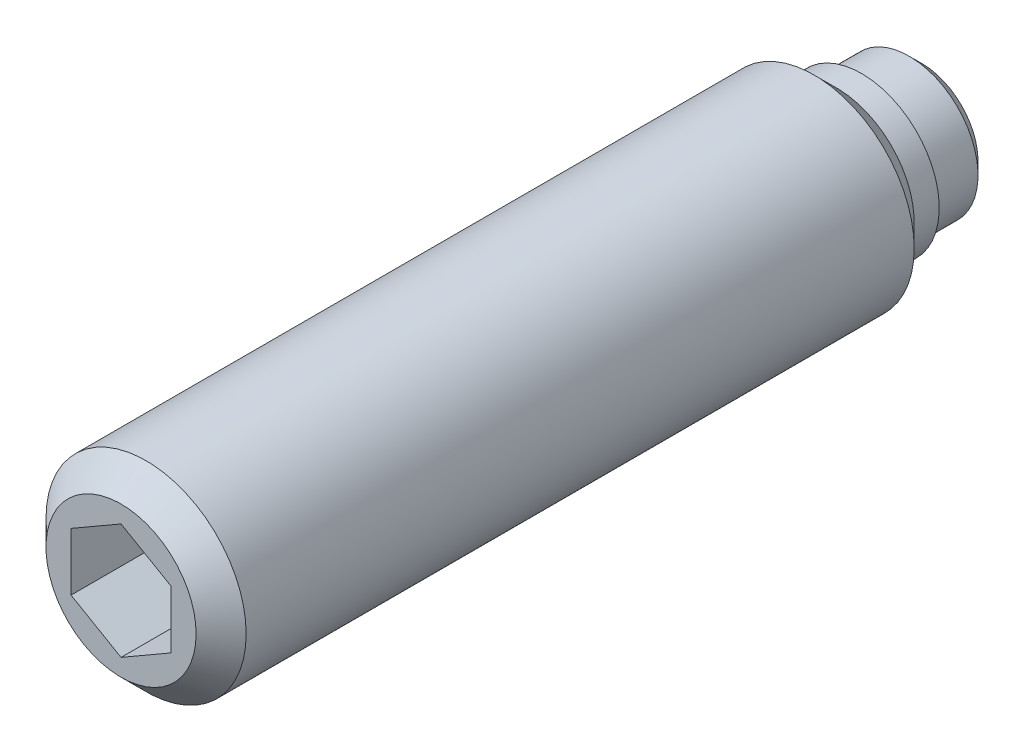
ISO-10303-21;
HEADER;
FILE_DESCRIPTION(('STEP AP214'),'2;1');
FILE_NAME('part.step','',(''),(''),'','','');
FILE_SCHEMA(('AUTOMOTIVE_DESIGN { 1 0 10303 214 1 1 1 1 }'));
ENDSEC;
DATA;
#1=APPLICATION_CONTEXT('core data for automotive mechanical design processes');
#2=APPLICATION_PROTOCOL_DEFINITION('international standard','automotive_design',2000,#1);
#3=PRODUCT_CONTEXT('',#1,'mechanical');
#4=PRODUCT('Part','Part','',(#3));
#5=PRODUCT_RELATED_PRODUCT_CATEGORY('part','',(#4));
#6=PRODUCT_DEFINITION_FORMATION('','',#4);
#7=PRODUCT_DEFINITION_CONTEXT('part definition',#1,'design');
#8=PRODUCT_DEFINITION('design','',#6,#7);
#9=PRODUCT_DEFINITION_SHAPE('','',#8);
#10=(LENGTH_UNIT() NAMED_UNIT(*) SI_UNIT(.MILLI.,.METRE.));
#11=(NAMED_UNIT(*) PLANE_ANGLE_UNIT() SI_UNIT($,.RADIAN.));
#12=(NAMED_UNIT(*) SI_UNIT($,.STERADIAN.) SOLID_ANGLE_UNIT());
#13=UNCERTAINTY_MEASURE_WITH_UNIT(LENGTH_MEASURE(1.E-05),#10,'distance_accuracy_value','');
#14=(GEOMETRIC_REPRESENTATION_CONTEXT(3) GLOBAL_UNCERTAINTY_ASSIGNED_CONTEXT((#13)) GLOBAL_UNIT_ASSIGNED_CONTEXT((#10,
#11,#12)) REPRESENTATION_CONTEXT('',''));
#15=CARTESIAN_POINT('',(0.,0.,0.));
#16=DIRECTION('',(0.,0.,1.));
#17=DIRECTION('',(1.,0.,0.));
#18=AXIS2_PLACEMENT_3D('',#15,#16,#17);
#19=CARTESIAN_POINT('',(0.,0.,2.4));
#20=DIRECTION('',(0.,0.,-1.));
#21=DIRECTION('',(-1.,0.,0.));
#22=AXIS2_PLACEMENT_3D('',#19,#20,#21);
#23=CYLINDRICAL_SURFACE('',#22,4.);
#24=CARTESIAN_POINT('',(0.,0.,4.3));
#25=DIRECTION('',(0.,0.,-1.));
#26=DIRECTION('',(-1.,0.,0.));
#27=AXIS2_PLACEMENT_3D('',#24,#25,#26);
#28=CIRCLE('',#27,4.);
#29=CARTESIAN_POINT('',(-4.,0.,4.3));
#30=VERTEX_POINT('',#29);
#31=EDGE_CURVE('E9',#30,#30,#28,.T.);
#32=ORIENTED_EDGE('',*,*,#31,.F.);
#33=EDGE_LOOP('',(#32));
#34=FACE_BOUND('',#33,.T.);
#35=CARTESIAN_POINT('',(0.,0.,31.));
#36=DIRECTION('',(0.,0.,1.));
#37=DIRECTION('',(1.,0.,0.));
#38=AXIS2_PLACEMENT_3D('',#35,#36,#37);
#39=CIRCLE('',#38,4.);
#40=CARTESIAN_POINT('',(4.,0.,31.));
#41=VERTEX_POINT('',#40);
#42=EDGE_CURVE('E70',#41,#41,#39,.T.);
#43=ORIENTED_EDGE('',*,*,#42,.F.);
#44=EDGE_LOOP('',(#43));
#45=FACE_BOUND('',#44,.T.);
#46=ADVANCED_FACE('F14',(#34,#45),#23,.T.);
#47=CARTESIAN_POINT('',(0.,0.,4.3));
#48=DIRECTION('',(0.,0.,1.));
#49=DIRECTION('',(1.,0.,0.));
#50=AXIS2_PLACEMENT_3D('',#47,#48,#49);
#51=CONICAL_SURFACE('',#50,4.,0.785398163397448);
#52=ORIENTED_EDGE('',*,*,#31,.T.);
#53=EDGE_LOOP('',(#52));
#54=FACE_BOUND('',#53,.T.);
#55=CARTESIAN_POINT('',(0.,0.,3.4));
#56=DIRECTION('',(0.,0.,-1.));
#57=DIRECTION('',(-1.,0.,0.));
#58=AXIS2_PLACEMENT_3D('',#55,#56,#57);
#59=CIRCLE('',#58,3.1);
#60=CARTESIAN_POINT('',(-3.1,0.,3.4));
#61=VERTEX_POINT('',#60);
#62=EDGE_CURVE('E21',#61,#61,#59,.T.);
#63=ORIENTED_EDGE('',*,*,#62,.F.);
#64=EDGE_LOOP('',(#63));
#65=FACE_BOUND('',#64,.T.);
#66=ADVANCED_FACE('F139',(#54,#65),#51,.T.);
#67=CARTESIAN_POINT('',(0.,0.,2.4));
#68=DIRECTION('',(0.,0.,-1.));
#69=DIRECTION('',(-1.,0.,0.));
#70=AXIS2_PLACEMENT_3D('',#67,#68,#69);
#71=CYLINDRICAL_SURFACE('',#70,3.1);
#72=ORIENTED_EDGE('',*,*,#62,.T.);
#73=EDGE_LOOP('',(#72));
#74=FACE_BOUND('',#73,.T.);
#75=CARTESIAN_POINT('',(0.,0.,2.4));
#76=DIRECTION('',(0.,0.,-1.));
#77=DIRECTION('',(-1.,0.,0.));
#78=AXIS2_PLACEMENT_3D('',#75,#76,#77);
#79=CIRCLE('',#78,3.1);
#80=CARTESIAN_POINT('',(-3.1,0.,2.4));
#81=VERTEX_POINT('',#80);
#82=EDGE_CURVE('E131',#81,#81,#79,.T.);
#83=ORIENTED_EDGE('',*,*,#82,.F.);
#84=EDGE_LOOP('',(#83));
#85=FACE_BOUND('',#84,.T.);
#86=ADVANCED_FACE('F136',(#74,#85),#71,.T.);
#87=CARTESIAN_POINT('',(0.,3.1,2.4));
#88=DIRECTION('',(0.,0.,1.));
#89=DIRECTION('',(1.,0.,0.));
#90=AXIS2_PLACEMENT_3D('',#87,#88,#89);
#91=PLANE('',#90);
#92=ORIENTED_EDGE('',*,*,#82,.T.);
#93=EDGE_LOOP('',(#92));
#94=FACE_BOUND('',#93,.T.);
#95=CARTESIAN_POINT('',(0.,0.,2.4));
#96=DIRECTION('',(0.,0.,-1.));
#97=DIRECTION('',(-1.,0.,0.));
#98=AXIS2_PLACEMENT_3D('',#95,#96,#97);
#99=CIRCLE('',#98,2.75);
#100=CARTESIAN_POINT('',(-2.75,0.,2.4));
#101=VERTEX_POINT('',#100);
#102=EDGE_CURVE('E128',#101,#101,#99,.T.);
#103=ORIENTED_EDGE('',*,*,#102,.F.);
#104=EDGE_LOOP('',(#103));
#105=FACE_BOUND('',#104,.T.);
#106=ADVANCED_FACE('F147',(#94,#105),#91,.F.);
#107=CARTESIAN_POINT('',(0.,0.,0.));
#108=DIRECTION('',(0.,0.,-1.));
#109=DIRECTION('',(-1.,0.,0.));
#110=AXIS2_PLACEMENT_3D('',#107,#108,#109);
#111=CYLINDRICAL_SURFACE('',#110,2.75);
#112=CARTESIAN_POINT('',(0.,0.,0.5));
#113=DIRECTION('',(0.,0.,-1.));
#114=DIRECTION('',(-1.,0.,0.));
#115=AXIS2_PLACEMENT_3D('',#112,#113,#114);
#116=CIRCLE('',#115,2.75);
#117=CARTESIAN_POINT('',(-2.75,0.,0.5));
#118=VERTEX_POINT('',#117);
#119=EDGE_CURVE('E125',#118,#118,#116,.T.);
#120=ORIENTED_EDGE('',*,*,#119,.F.);
#121=EDGE_LOOP('',(#120));
#122=FACE_BOUND('',#121,.T.);
#123=ORIENTED_EDGE('',*,*,#102,.T.);
#124=EDGE_LOOP('',(#123));
#125=FACE_BOUND('',#124,.T.);
#126=ADVANCED_FACE('F153',(#122,#125),#111,.T.);
#127=CARTESIAN_POINT('',(0.,0.,0.5));
#128=DIRECTION('',(0.,0.,1.));
#129=DIRECTION('',(1.,0.,0.));
#130=AXIS2_PLACEMENT_3D('',#127,#128,#129);
#131=CONICAL_SURFACE('',#130,2.75,0.785398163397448);
#132=CARTESIAN_POINT('',(0.,0.,0.));
#133=DIRECTION('',(0.,0.,-1.));
#134=DIRECTION('',(-1.,0.,0.));
#135=AXIS2_PLACEMENT_3D('',#132,#133,#134);
#136=CIRCLE('',#135,2.25);
#137=CARTESIAN_POINT('',(-2.25,0.,0.));
#138=VERTEX_POINT('',#137);
#139=EDGE_CURVE('E122',#138,#138,#136,.T.);
#140=ORIENTED_EDGE('',*,*,#139,.F.);
#141=EDGE_LOOP('',(#140));
#142=FACE_BOUND('',#141,.T.);
#143=ORIENTED_EDGE('',*,*,#119,.T.);
#144=EDGE_LOOP('',(#143));
#145=FACE_BOUND('',#144,.T.);
#146=ADVANCED_FACE('F157',(#142,#145),#131,.T.);
#147=CARTESIAN_POINT('',(0.,2.25,0.));
#148=DIRECTION('',(0.,0.,1.));
#149=DIRECTION('',(1.,0.,0.));
#150=AXIS2_PLACEMENT_3D('',#147,#148,#149);
#151=PLANE('',#150);
#152=ORIENTED_EDGE('',*,*,#139,.T.);
#153=EDGE_LOOP('',(#152));
#154=FACE_BOUND('',#153,.T.);
#155=ADVANCED_FACE('F161',(#154),#151,.F.);
#156=CARTESIAN_POINT('',(0.,0.,32.));
#157=DIRECTION('',(0.,0.,1.));
#158=DIRECTION('',(1.,0.,0.));
#159=AXIS2_PLACEMENT_3D('',#156,#157,#158);
#160=PLANE('',#159);
#161=DIRECTION('',(0.866025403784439,-0.5,0.));
#162=VECTOR('',#161,1.);
#163=CARTESIAN_POINT('',(-2.,-1.15470053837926,32.));
#164=LINE('',#163,#162);
#165=CARTESIAN_POINT('',(-2.,-1.15470053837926,32.));
#166=VERTEX_POINT('',#165);
#167=CARTESIAN_POINT('',(0.,-2.30940107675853,32.));
#168=VERTEX_POINT('',#167);
#169=EDGE_CURVE('E28',#166,#168,#164,.T.);
#170=ORIENTED_EDGE('',*,*,#169,.F.);
#171=DIRECTION('',(0.,-1.,0.));
#172=VECTOR('',#171,1.);
#173=CARTESIAN_POINT('',(-2.,1.15470053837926,32.));
#174=LINE('',#173,#172);
#175=CARTESIAN_POINT('',(-2.,1.15470053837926,32.));
#176=VERTEX_POINT('',#175);
#177=EDGE_CURVE('E69',#176,#166,#174,.T.);
#178=ORIENTED_EDGE('',*,*,#177,.F.);
#179=DIRECTION('',(-0.866025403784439,-0.5,0.));
#180=VECTOR('',#179,1.);
#181=CARTESIAN_POINT('',(0.,2.30940107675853,32.));
#182=LINE('',#181,#180);
#183=CARTESIAN_POINT('',(0.,2.30940107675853,32.));
#184=VERTEX_POINT('',#183);
#185=EDGE_CURVE('E105',#184,#176,#182,.T.);
#186=ORIENTED_EDGE('',*,*,#185,.F.);
#187=DIRECTION('',(-0.866025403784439,0.5,0.));
#188=VECTOR('',#187,1.);
#189=CARTESIAN_POINT('',(2.,1.15470053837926,32.));
#190=LINE('',#189,#188);
#191=CARTESIAN_POINT('',(2.,1.15470053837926,32.));
#192=VERTEX_POINT('',#191);
#193=EDGE_CURVE('E102',#192,#184,#190,.T.);
#194=ORIENTED_EDGE('',*,*,#193,.F.);
#195=DIRECTION('',(0.,1.,0.));
#196=VECTOR('',#195,1.);
#197=CARTESIAN_POINT('',(2.,-1.15470053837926,32.));
#198=LINE('',#197,#196);
#199=CARTESIAN_POINT('',(2.,-1.15470053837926,32.));
#200=VERTEX_POINT('',#199);
#201=EDGE_CURVE('E99',#200,#192,#198,.T.);
#202=ORIENTED_EDGE('',*,*,#201,.F.);
#203=DIRECTION('',(0.866025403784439,0.5,0.));
#204=VECTOR('',#203,1.);
#205=CARTESIAN_POINT('',(0.,-2.30940107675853,32.));
#206=LINE('',#205,#204);
#207=EDGE_CURVE('E96',#168,#200,#206,.T.);
#208=ORIENTED_EDGE('',*,*,#207,.F.);
#209=EDGE_LOOP('',(#170,#178,#186,#194,#202,#208));
#210=FACE_BOUND('',#209,.T.);
#211=CARTESIAN_POINT('',(0.,0.,32.));
#212=DIRECTION('',(0.,0.,1.));
#213=DIRECTION('',(1.,0.,0.));
#214=AXIS2_PLACEMENT_3D('',#211,#212,#213);
#215=CIRCLE('',#214,3.);
#216=CARTESIAN_POINT('',(3.,0.,32.));
#217=VERTEX_POINT('',#216);
#218=EDGE_CURVE('E119',#217,#217,#215,.T.);
#219=ORIENTED_EDGE('',*,*,#218,.T.);
#220=EDGE_LOOP('',(#219));
#221=FACE_BOUND('',#220,.T.);
#222=ADVANCED_FACE('F165',(#210,#221),#160,.T.);
#223=CARTESIAN_POINT('',(0.,0.,32.));
#224=DIRECTION('',(0.,0.,-1.));
#225=DIRECTION('',(-1.,0.,0.));
#226=AXIS2_PLACEMENT_3D('',#223,#224,#225);
#227=CONICAL_SURFACE('',#226,3.,0.785398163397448);
#228=ORIENTED_EDGE('',*,*,#42,.T.);
#229=EDGE_LOOP('',(#228));
#230=FACE_BOUND('',#229,.T.);
#231=ORIENTED_EDGE('',*,*,#218,.F.);
#232=EDGE_LOOP('',(#231));
#233=FACE_BOUND('',#232,.T.);
#234=ADVANCED_FACE('F169',(#230,#233),#227,.T.);
#235=CARTESIAN_POINT('',(-2.,-1.15470053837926,29.));
#236=DIRECTION('',(-0.5,-0.866025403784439,0.));
#237=DIRECTION('',(0.866025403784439,-0.5,0.));
#238=AXIS2_PLACEMENT_3D('',#235,#236,#237);
#239=PLANE('',#238);
#240=ORIENTED_EDGE('',*,*,#169,.T.);
#241=DIRECTION('',(0.,0.,1.));
#242=VECTOR('',#241,1.);
#243=CARTESIAN_POINT('',(0.,-2.30940107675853,29.));
#244=LINE('',#243,#242);
#245=CARTESIAN_POINT('',(0.,-2.30940107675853,27.));
#246=VERTEX_POINT('',#245);
#247=EDGE_CURVE('E76',#246,#168,#244,.T.);
#248=ORIENTED_EDGE('',*,*,#247,.F.);
#249=DIRECTION('',(0.866025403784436,-0.5,0.));
#250=VECTOR('',#249,1.);
#251=CARTESIAN_POINT('',(-2.,-1.15470053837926,27.));
#252=LINE('',#251,#250);
#253=CARTESIAN_POINT('',(-2.,-1.15470053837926,27.));
#254=VERTEX_POINT('',#253);
#255=EDGE_CURVE('E74',#254,#246,#252,.T.);
#256=ORIENTED_EDGE('',*,*,#255,.F.);
#257=DIRECTION('',(0.,0.,1.));
#258=VECTOR('',#257,1.);
#259=CARTESIAN_POINT('',(-2.,-1.15470053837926,29.));
#260=LINE('',#259,#258);
#261=EDGE_CURVE('E33',#254,#166,#260,.T.);
#262=ORIENTED_EDGE('',*,*,#261,.T.);
#263=EDGE_LOOP('',(#240,#248,#256,#262));
#264=FACE_BOUND('',#263,.T.);
#265=ADVANCED_FACE('F75',(#264),#239,.F.);
#266=CARTESIAN_POINT('',(-2.,1.15470053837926,29.));
#267=DIRECTION('',(-1.,0.,0.));
#268=DIRECTION('',(0.,0.,1.));
#269=AXIS2_PLACEMENT_3D('',#266,#267,#268);
#270=PLANE('',#269);
#271=ORIENTED_EDGE('',*,*,#177,.T.);
#272=ORIENTED_EDGE('',*,*,#261,.F.);
#273=DIRECTION('',(0.,-1.,0.));
#274=VECTOR('',#273,1.);
#275=CARTESIAN_POINT('',(-2.,1.15470053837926,27.));
#276=LINE('',#275,#274);
#277=CARTESIAN_POINT('',(-2.,1.15470053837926,27.));
#278=VERTEX_POINT('',#277);
#279=EDGE_CURVE('E66',#278,#254,#276,.T.);
#280=ORIENTED_EDGE('',*,*,#279,.F.);
#281=DIRECTION('',(0.,0.,1.));
#282=VECTOR('',#281,1.);
#283=CARTESIAN_POINT('',(-2.,1.15470053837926,29.));
#284=LINE('',#283,#282);
#285=EDGE_CURVE('E71',#278,#176,#284,.T.);
#286=ORIENTED_EDGE('',*,*,#285,.T.);
#287=EDGE_LOOP('',(#271,#272,#280,#286));
#288=FACE_BOUND('',#287,.T.);
#289=ADVANCED_FACE('F64',(#288),#270,.F.);
#290=CARTESIAN_POINT('',(0.,2.30940107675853,29.));
#291=DIRECTION('',(-0.5,0.866025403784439,0.));
#292=DIRECTION('',(-0.866025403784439,-0.5,0.));
#293=AXIS2_PLACEMENT_3D('',#290,#291,#292);
#294=PLANE('',#293);
#295=ORIENTED_EDGE('',*,*,#185,.T.);
#296=ORIENTED_EDGE('',*,*,#285,.F.);
#297=DIRECTION('',(-0.866025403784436,-0.5,0.));
#298=VECTOR('',#297,1.);
#299=CARTESIAN_POINT('',(0.,2.30940107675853,27.));
#300=LINE('',#299,#298);
#301=CARTESIAN_POINT('',(0.,2.30940107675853,27.));
#302=VERTEX_POINT('',#301);
#303=EDGE_CURVE('E85',#302,#278,#300,.T.);
#304=ORIENTED_EDGE('',*,*,#303,.F.);
#305=DIRECTION('',(0.,0.,1.));
#306=VECTOR('',#305,1.);
#307=CARTESIAN_POINT('',(0.,2.30940107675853,29.));
#308=LINE('',#307,#306);
#309=EDGE_CURVE('E110',#302,#184,#308,.T.);
#310=ORIENTED_EDGE('',*,*,#309,.T.);
#311=EDGE_LOOP('',(#295,#296,#304,#310));
#312=FACE_BOUND('',#311,.T.);
#313=ADVANCED_FACE('F187',(#312),#294,.F.);
#314=CARTESIAN_POINT('',(2.,1.15470053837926,29.));
#315=DIRECTION('',(0.5,0.866025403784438,0.));
#316=DIRECTION('',(-0.866025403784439,0.5,0.));
#317=AXIS2_PLACEMENT_3D('',#314,#315,#316);
#318=PLANE('',#317);
#319=ORIENTED_EDGE('',*,*,#193,.T.);
#320=ORIENTED_EDGE('',*,*,#309,.F.);
#321=DIRECTION('',(-0.866025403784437,0.5,0.));
#322=VECTOR('',#321,1.);
#323=CARTESIAN_POINT('',(2.,1.15470053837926,27.));
#324=LINE('',#323,#322);
#325=CARTESIAN_POINT('',(2.,1.15470053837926,27.));
#326=VERTEX_POINT('',#325);
#327=EDGE_CURVE('E92',#326,#302,#324,.T.);
#328=ORIENTED_EDGE('',*,*,#327,.F.);
#329=DIRECTION('',(0.,0.,1.));
#330=VECTOR('',#329,1.);
#331=CARTESIAN_POINT('',(2.,1.15470053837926,29.));
#332=LINE('',#331,#330);
#333=EDGE_CURVE('E112',#326,#192,#332,.T.);
#334=ORIENTED_EDGE('',*,*,#333,.T.);
#335=EDGE_LOOP('',(#319,#320,#328,#334));
#336=FACE_BOUND('',#335,.T.);
#337=ADVANCED_FACE('F183',(#336),#318,.F.);
#338=CARTESIAN_POINT('',(2.,-1.15470053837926,29.));
#339=DIRECTION('',(1.,0.,0.));
#340=DIRECTION('',(0.,0.,-1.));
#341=AXIS2_PLACEMENT_3D('',#338,#339,#340);
#342=PLANE('',#341);
#343=ORIENTED_EDGE('',*,*,#201,.T.);
#344=ORIENTED_EDGE('',*,*,#333,.F.);
#345=DIRECTION('',(0.,1.,0.));
#346=VECTOR('',#345,1.);
#347=CARTESIAN_POINT('',(2.,-1.15470053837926,27.));
#348=LINE('',#347,#346);
#349=CARTESIAN_POINT('',(2.,-1.15470053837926,27.));
#350=VERTEX_POINT('',#349);
#351=EDGE_CURVE('E89',#350,#326,#348,.T.);
#352=ORIENTED_EDGE('',*,*,#351,.F.);
#353=DIRECTION('',(0.,0.,1.));
#354=VECTOR('',#353,1.);
#355=CARTESIAN_POINT('',(2.,-1.15470053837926,29.));
#356=LINE('',#355,#354);
#357=EDGE_CURVE('E114',#350,#200,#356,.T.);
#358=ORIENTED_EDGE('',*,*,#357,.T.);
#359=EDGE_LOOP('',(#343,#344,#352,#358));
#360=FACE_BOUND('',#359,.T.);
#361=ADVANCED_FACE('F179',(#360),#342,.F.);
#362=CARTESIAN_POINT('',(0.,-2.30940107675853,29.));
#363=DIRECTION('',(0.5,-0.866025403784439,0.));
#364=DIRECTION('',(0.866025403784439,0.5,0.));
#365=AXIS2_PLACEMENT_3D('',#362,#363,#364);
#366=PLANE('',#365);
#367=ORIENTED_EDGE('',*,*,#207,.T.);
#368=ORIENTED_EDGE('',*,*,#357,.F.);
#369=DIRECTION('',(0.866025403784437,0.5,0.));
#370=VECTOR('',#369,1.);
#371=CARTESIAN_POINT('',(0.,-2.30940107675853,27.));
#372=LINE('',#371,#370);
#373=EDGE_CURVE('E80',#246,#350,#372,.T.);
#374=ORIENTED_EDGE('',*,*,#373,.F.);
#375=ORIENTED_EDGE('',*,*,#247,.T.);
#376=EDGE_LOOP('',(#367,#368,#374,#375));
#377=FACE_BOUND('',#376,.T.);
#378=ADVANCED_FACE('F176',(#377),#366,.F.);
#379=CARTESIAN_POINT('',(0.,0.,27.));
#380=DIRECTION('',(0.,0.,1.));
#381=DIRECTION('',(1.,0.,0.));
#382=AXIS2_PLACEMENT_3D('',#379,#380,#381);
#383=PLANE('',#382);
#384=ORIENTED_EDGE('',*,*,#279,.T.);
#385=ORIENTED_EDGE('',*,*,#255,.T.);
#386=ORIENTED_EDGE('',*,*,#373,.T.);
#387=ORIENTED_EDGE('',*,*,#351,.T.);
#388=ORIENTED_EDGE('',*,*,#327,.T.);
#389=ORIENTED_EDGE('',*,*,#303,.T.);
#390=EDGE_LOOP('',(#384,#385,#386,#387,#388,#389));
#391=FACE_BOUND('',#390,.T.);
#392=ADVANCED_FACE('F82',(#391),#383,.T.);
#393=CLOSED_SHELL('',(#46,#66,#86,#106,#126,#146,#155,#222,#234,#265,#289,#313,#337,#361,#378,#392));
#394=MANIFOLD_SOLID_BREP('B1',#393);
#395=ADVANCED_BREP_SHAPE_REPRESENTATION('',(#18,#394),#14);
#396=SHAPE_DEFINITION_REPRESENTATION(#9,#395);
ENDSEC;
END-ISO-10303-21;
